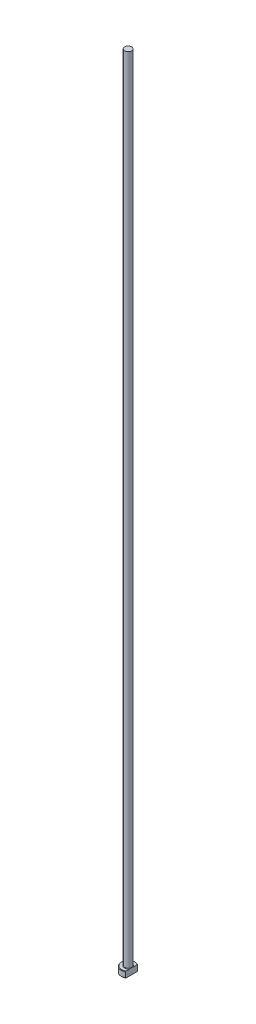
from build123d import *
from build123d.topology import SkipClean

# Parameters (mm, degrees)
CHAMFER1_SIZE = 0.2
FILLET1_R     = 0.2
KEY_DEPTH     = 401.030623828


with BuildPart() as part:
    # Sketch1 → Revolve1 (revolve)
    with BuildSketch(Plane.XY, mode=Mode.PRIVATE) as revolve1_sk:
        Polygon((0, 0), (-3.5, 0), (-3.5, 3), (-1.75, 3), (-1.75, 400), (0, 400), align=None)
    revolve(revolve1_sk.sketch.rotate(Axis((0, 259.958771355, 0), (0, -1, 0)), 270), axis=Axis((0, 259.958771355, 0), (0, -1, 0)))

    # Chamfer1
    chamfer1_edges = [part.edges().sort_by_distance(p)[0] for p in [
        (0, 3, -3.5),
        (0, 0, -3.5),
    ]]
    chamfer(chamfer1_edges, length=CHAMFER1_SIZE)

    # Fillet1
    fillet1_edges = [part.edges().sort_by_distance(p)[0] for p in [
        (0, 3, -1.75),
    ]]
    fillet(fillet1_edges, radius=FILLET1_R)

    # Sketch2 → KEY (cut, through all)
    with SkipClean():  # the faces are left unmerged after this step: merging them gives an invalid solid
        with BuildSketch(Plane(origin=(0, 0, 0), x_dir=(1, 0, 0), z_dir=(0, 1, 0))):
            with BuildLine():
                Line((1.75, 3.031088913), (1.75, -3.031088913))
                ThreePointArc((1.75, -3.031088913), (3.5, 0), (1.75, 3.031088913))
            make_face()
        extrude(amount=KEY_DEPTH, mode=Mode.SUBTRACT)


solid = part.part
